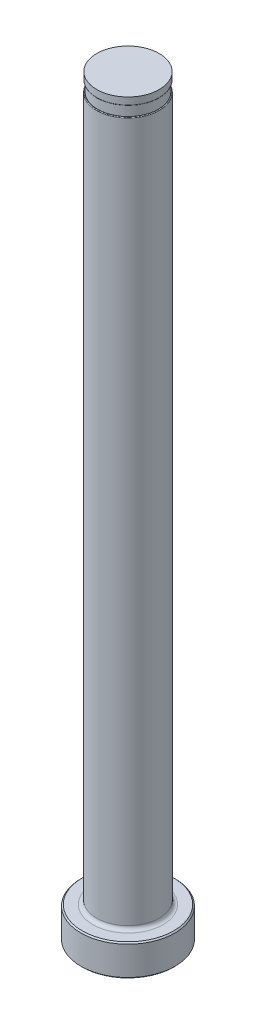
ISO-10303-21;
HEADER;
FILE_DESCRIPTION(('STEP AP214'),'2;1');
FILE_NAME('part.step','',(''),(''),'','','');
FILE_SCHEMA(('AUTOMOTIVE_DESIGN { 1 0 10303 214 1 1 1 1 }'));
ENDSEC;
DATA;
#1=APPLICATION_CONTEXT('core data for automotive mechanical design processes');
#2=APPLICATION_PROTOCOL_DEFINITION('international standard','automotive_design',2000,#1);
#3=PRODUCT_CONTEXT('',#1,'mechanical');
#4=PRODUCT('Part','Part','',(#3));
#5=PRODUCT_RELATED_PRODUCT_CATEGORY('part','',(#4));
#6=PRODUCT_DEFINITION_FORMATION('','',#4);
#7=PRODUCT_DEFINITION_CONTEXT('part definition',#1,'design');
#8=PRODUCT_DEFINITION('design','',#6,#7);
#9=PRODUCT_DEFINITION_SHAPE('','',#8);
#10=(LENGTH_UNIT() NAMED_UNIT(*) SI_UNIT(.MILLI.,.METRE.));
#11=(NAMED_UNIT(*) PLANE_ANGLE_UNIT() SI_UNIT($,.RADIAN.));
#12=(NAMED_UNIT(*) SI_UNIT($,.STERADIAN.) SOLID_ANGLE_UNIT());
#13=UNCERTAINTY_MEASURE_WITH_UNIT(LENGTH_MEASURE(1.E-05),#10,'distance_accuracy_value','');
#14=(GEOMETRIC_REPRESENTATION_CONTEXT(3) GLOBAL_UNCERTAINTY_ASSIGNED_CONTEXT((#13)) GLOBAL_UNIT_ASSIGNED_CONTEXT((#10,
#11,#12)) REPRESENTATION_CONTEXT('',''));
#15=CARTESIAN_POINT('',(0.,0.,0.));
#16=DIRECTION('',(0.,0.,1.));
#17=DIRECTION('',(1.,0.,0.));
#18=AXIS2_PLACEMENT_3D('',#15,#16,#17);
#19=CARTESIAN_POINT('',(-6.34999999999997,150.876,0.));
#20=DIRECTION('',(0.,1.,0.));
#21=DIRECTION('',(0.,0.,1.));
#22=AXIS2_PLACEMENT_3D('',#19,#20,#21);
#23=PLANE('',#22);
#24=CARTESIAN_POINT('',(0.,150.876,0.));
#25=DIRECTION('',(0.,1.,0.));
#26=DIRECTION('',(0.,0.,1.));
#27=AXIS2_PLACEMENT_3D('',#24,#25,#26);
#28=CIRCLE('',#27,6.19759999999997);
#29=CARTESIAN_POINT('',(0.,150.876,6.19759999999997));
#30=VERTEX_POINT('',#29);
#31=EDGE_CURVE('E11',#30,#30,#28,.F.);
#32=ORIENTED_EDGE('',*,*,#31,.T.);
#33=EDGE_LOOP('',(#32));
#34=FACE_BOUND('',#33,.T.);
#35=CARTESIAN_POINT('',(0.,150.876,0.));
#36=DIRECTION('',(0.,1.,0.));
#37=DIRECTION('',(0.,0.,1.));
#38=AXIS2_PLACEMENT_3D('',#35,#36,#37);
#39=CIRCLE('',#38,6.14679999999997);
#40=CARTESIAN_POINT('',(0.,150.876,6.14679999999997));
#41=VERTEX_POINT('',#40);
#42=EDGE_CURVE('E78',#41,#41,#39,.T.);
#43=ORIENTED_EDGE('',*,*,#42,.T.);
#44=EDGE_LOOP('',(#43));
#45=FACE_BOUND('',#44,.T.);
#46=ADVANCED_FACE('F36',(#34,#45),#23,.F.);
#47=CARTESIAN_POINT('',(0.,259.958771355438,0.));
#48=DIRECTION('',(0.,1.,0.));
#49=DIRECTION('',(0.,0.,1.));
#50=AXIS2_PLACEMENT_3D('',#47,#48,#49);
#51=CYLINDRICAL_SURFACE('',#50,6.34999999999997);
#52=DIRECTION('',(0.,1.,0.));
#53=VECTOR('',#52,1.);
#54=CARTESIAN_POINT('',(-6.14679999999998,259.958771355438,-1.59353373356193));
#55=LINE('',#54,#53);
#56=CARTESIAN_POINT('',(-6.14679999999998,148.717,-1.59353373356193));
#57=VERTEX_POINT('',#56);
#58=CARTESIAN_POINT('',(-6.14679999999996,86.36,-1.593533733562));
#59=VERTEX_POINT('',#58);
#60=EDGE_CURVE('E73',#57,#59,#55,.F.);
#61=ORIENTED_EDGE('',*,*,#60,.F.);
#62=CARTESIAN_POINT('',(0.,148.717,0.));
#63=DIRECTION('',(0.,-1.,0.));
#64=DIRECTION('',(0.,0.,-1.));
#65=AXIS2_PLACEMENT_3D('',#62,#63,#64);
#66=CIRCLE('',#65,6.34999999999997);
#67=CARTESIAN_POINT('',(-6.14679999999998,148.717,1.59353373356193));
#68=VERTEX_POINT('',#67);
#69=EDGE_CURVE('E51',#57,#68,#66,.T.);
#70=ORIENTED_EDGE('',*,*,#69,.T.);
#71=DIRECTION('',(0.,1.,0.));
#72=VECTOR('',#71,1.);
#73=CARTESIAN_POINT('',(-6.14679999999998,259.958771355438,1.59353373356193));
#74=LINE('',#73,#72);
#75=CARTESIAN_POINT('',(-6.14679999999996,86.36,1.593533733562));
#76=VERTEX_POINT('',#75);
#77=EDGE_CURVE('E84',#76,#68,#74,.T.);
#78=ORIENTED_EDGE('',*,*,#77,.F.);
#79=CARTESIAN_POINT('',(-6.14679999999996,86.36,-1.593533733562));
#80=CARTESIAN_POINT('',(-6.14679686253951,86.3324663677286,-1.59353938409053));
#81=CARTESIAN_POINT('',(-6.14715862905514,86.3049529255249,-1.59215087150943));
#82=CARTESIAN_POINT('',(-6.14858031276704,86.2502441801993,-1.58665454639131));
#83=CARTESIAN_POINT('',(-6.14963953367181,86.2230485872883,-1.58254944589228));
#84=CARTESIAN_POINT('',(-6.15378495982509,86.1428935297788,-1.56638373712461));
#85=CARTESIAN_POINT('',(-6.15784047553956,86.0907192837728,-1.55046902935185));
#86=CARTESIAN_POINT('',(-6.16796669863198,85.9905368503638,-1.50967436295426));
#87=CARTESIAN_POINT('',(-6.17403041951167,85.9425149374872,-1.48482546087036));
#88=CARTESIAN_POINT('',(-6.18749023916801,85.8512134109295,-1.42770042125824));
#89=CARTESIAN_POINT('',(-6.19488985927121,85.8079468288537,-1.39540459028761));
#90=CARTESIAN_POINT('',(-6.2128308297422,85.7135154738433,-1.31357934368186));
#91=CARTESIAN_POINT('',(-6.22361527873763,85.6643096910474,-1.26185217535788));
#92=CARTESIAN_POINT('',(-6.24504791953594,85.5749285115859,-1.15112070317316));
#93=CARTESIAN_POINT('',(-6.25569585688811,85.5347681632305,-1.0921045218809));
#94=CARTESIAN_POINT('',(-6.27981252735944,85.4491635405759,-0.945436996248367));
#95=CARTESIAN_POINT('',(-6.29280304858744,85.4075705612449,-0.855464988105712));
#96=CARTESIAN_POINT('',(-6.3152685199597,85.33888021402,-0.669832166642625));
#97=CARTESIAN_POINT('',(-6.32474033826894,85.3117957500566,-0.574166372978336));
#98=CARTESIAN_POINT('',(-6.33958312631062,85.2702724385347,-0.377105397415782));
#99=CARTESIAN_POINT('',(-6.34483489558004,85.256199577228,-0.275625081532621));
#100=CARTESIAN_POINT('',(-6.35041977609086,85.2412595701,-0.0715187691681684));
#101=CARTESIAN_POINT('',(-6.35074885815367,85.240403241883,0.031108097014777));
#102=CARTESIAN_POINT('',(-6.34600640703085,85.2530416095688,0.25671763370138));
#103=CARTESIAN_POINT('',(-6.33980431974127,85.2695397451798,0.37952238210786));
#104=CARTESIAN_POINT('',(-6.32079279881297,85.322979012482,0.620117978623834));
#105=CARTESIAN_POINT('',(-6.30799326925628,85.3598895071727,0.737916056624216));
#106=CARTESIAN_POINT('',(-6.28320612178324,85.4388252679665,0.921417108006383));
#107=CARTESIAN_POINT('',(-6.27266140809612,85.4739385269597,0.990304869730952));
#108=CARTESIAN_POINT('',(-6.25047734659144,85.5541826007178,1.12180209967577));
#109=CARTESIAN_POINT('',(-6.23883987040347,85.5992964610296,1.18442193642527));
#110=CARTESIAN_POINT('',(-6.21836351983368,85.6885218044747,1.28706750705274));
#111=CARTESIAN_POINT('',(-6.20949901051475,85.7304586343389,1.32897137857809));
#112=CARTESIAN_POINT('',(-6.19260904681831,85.820662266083,1.40556985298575));
#113=CARTESIAN_POINT('',(-6.18458268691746,85.8689221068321,1.44027227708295));
#114=CARTESIAN_POINT('',(-6.17157345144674,85.961899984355,1.49493371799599));
#115=CARTESIAN_POINT('',(-6.16630262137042,86.0056744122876,1.51642497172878));
#116=CARTESIAN_POINT('',(-6.1574469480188,86.0962717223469,1.55199425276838));
#117=CARTESIAN_POINT('',(-6.15385883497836,86.1430884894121,1.56608666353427));
#118=CARTESIAN_POINT('',(-6.14982923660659,86.2185672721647,1.58181403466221));
#119=CARTESIAN_POINT('',(-6.14869942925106,86.2466434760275,1.58619374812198));
#120=CARTESIAN_POINT('',(-6.147182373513,86.3031398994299,1.59205902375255));
#121=CARTESIAN_POINT('',(-6.14679576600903,86.3315603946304,1.59354208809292));
#122=CARTESIAN_POINT('',(-6.14679999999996,86.36,1.593533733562));
#123=B_SPLINE_CURVE_WITH_KNOTS('',3,(#79,#80,#81,#82,#83,#84,#85,#86,#87,#88,#89,#90,#91,#92,
#93,#94,#95,#96,#97,#98,#99,#100,#101,#102,#103,#104,#105,#106,#107,#108,#109,#110,#111,#112,
#113,#114,#115,#116,#117,#118,#119,#120,#121,#122),.UNSPECIFIED.,.F.,.F.,(4,2,2,2,2,2,2,2,2,2,2,
2,2,2,2,2,2,2,2,2,2,4),(0.,0.0825255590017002,0.164968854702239,0.327951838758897,
0.490373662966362,0.653230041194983,0.868657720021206,1.08444118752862,1.38273372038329,
1.68129111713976,1.9880112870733,2.29498249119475,2.66541500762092,3.03529304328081,
3.26869881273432,3.50171186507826,3.68091203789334,3.85991655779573,4.00647458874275,
4.15274664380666,4.23791544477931,4.32315765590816),.UNSPECIFIED.);
#124=EDGE_CURVE('E81',#59,#76,#123,.T.);
#125=ORIENTED_EDGE('',*,*,#124,.F.);
#126=EDGE_LOOP('',(#61,#70,#78,#125));
#127=FACE_BOUND('',#126,.T.);
#128=CARTESIAN_POINT('',(0.,7.11200000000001,0.));
#129=DIRECTION('',(0.,1.,0.));
#130=DIRECTION('',(0.,0.,1.));
#131=AXIS2_PLACEMENT_3D('',#128,#129,#130);
#132=CIRCLE('',#131,6.34999999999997);
#133=CARTESIAN_POINT('',(0.,7.11200000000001,6.34999999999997));
#134=VERTEX_POINT('',#133);
#135=EDGE_CURVE('E116',#134,#134,#132,.T.);
#136=ORIENTED_EDGE('',*,*,#135,.T.);
#137=EDGE_LOOP('',(#136));
#138=FACE_BOUND('',#137,.T.);
#139=ADVANCED_FACE('F82',(#127,#138),#51,.T.);
#140=CARTESIAN_POINT('',(0.,0.,0.));
#141=DIRECTION('',(0.,-1.,0.));
#142=DIRECTION('',(0.,0.,-1.));
#143=AXIS2_PLACEMENT_3D('',#140,#141,#142);
#144=PLANE('',#143);
#145=CARTESIAN_POINT('',(0.,0.,0.));
#146=DIRECTION('',(0.,-1.,0.));
#147=DIRECTION('',(0.,0.,-1.));
#148=AXIS2_PLACEMENT_3D('',#145,#146,#147);
#149=CIRCLE('',#148,9.271);
#150=CARTESIAN_POINT('',(0.,0.,-9.271));
#151=VERTEX_POINT('',#150);
#152=EDGE_CURVE('E113',#151,#151,#149,.T.);
#153=ORIENTED_EDGE('',*,*,#152,.T.);
#154=EDGE_LOOP('',(#153));
#155=FACE_BOUND('',#154,.T.);
#156=ADVANCED_FACE('F192',(#155),#144,.T.);
#157=CARTESIAN_POINT('',(0.,259.958771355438,0.));
#158=DIRECTION('',(0.,1.,0.));
#159=DIRECTION('',(0.,0.,1.));
#160=AXIS2_PLACEMENT_3D('',#157,#158,#159);
#161=CYLINDRICAL_SURFACE('',#160,9.52499999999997);
#162=CARTESIAN_POINT('',(0.,6.09600000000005,0.));
#163=DIRECTION('',(0.,1.,0.));
#164=DIRECTION('',(0.,0.,1.));
#165=AXIS2_PLACEMENT_3D('',#162,#163,#164);
#166=CIRCLE('',#165,9.52499999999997);
#167=CARTESIAN_POINT('',(0.,6.09600000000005,9.52499999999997));
#168=VERTEX_POINT('',#167);
#169=EDGE_CURVE('E110',#168,#168,#166,.F.);
#170=ORIENTED_EDGE('',*,*,#169,.T.);
#171=EDGE_LOOP('',(#170));
#172=FACE_BOUND('',#171,.T.);
#173=CARTESIAN_POINT('',(0.,0.253999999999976,0.));
#174=DIRECTION('',(0.,-1.,0.));
#175=DIRECTION('',(0.,0.,-1.));
#176=AXIS2_PLACEMENT_3D('',#173,#174,#175);
#177=CIRCLE('',#176,9.52499999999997);
#178=CARTESIAN_POINT('',(0.,0.253999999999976,-9.52499999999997));
#179=VERTEX_POINT('',#178);
#180=EDGE_CURVE('E107',#179,#179,#177,.F.);
#181=ORIENTED_EDGE('',*,*,#180,.T.);
#182=EDGE_LOOP('',(#181));
#183=FACE_BOUND('',#182,.T.);
#184=ADVANCED_FACE('F195',(#172,#183),#161,.T.);
#185=CARTESIAN_POINT('',(-9.52499999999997,6.35,0.));
#186=DIRECTION('',(0.,1.,0.));
#187=DIRECTION('',(0.,0.,1.));
#188=AXIS2_PLACEMENT_3D('',#185,#186,#187);
#189=PLANE('',#188);
#190=CARTESIAN_POINT('',(0.,6.35,0.));
#191=DIRECTION('',(0.,1.,0.));
#192=DIRECTION('',(0.,0.,1.));
#193=AXIS2_PLACEMENT_3D('',#190,#191,#192);
#194=CIRCLE('',#193,7.11199999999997);
#195=CARTESIAN_POINT('',(0.,6.35,7.11199999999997));
#196=VERTEX_POINT('',#195);
#197=EDGE_CURVE('E87',#196,#196,#194,.F.);
#198=ORIENTED_EDGE('',*,*,#197,.T.);
#199=EDGE_LOOP('',(#198));
#200=FACE_BOUND('',#199,.T.);
#201=CARTESIAN_POINT('',(0.,6.35,0.));
#202=DIRECTION('',(0.,1.,0.));
#203=DIRECTION('',(0.,0.,1.));
#204=AXIS2_PLACEMENT_3D('',#201,#202,#203);
#205=CIRCLE('',#204,9.27100000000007);
#206=CARTESIAN_POINT('',(0.,6.35,9.27100000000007));
#207=VERTEX_POINT('',#206);
#208=EDGE_CURVE('E104',#207,#207,#205,.T.);
#209=ORIENTED_EDGE('',*,*,#208,.T.);
#210=EDGE_LOOP('',(#209));
#211=FACE_BOUND('',#210,.T.);
#212=ADVANCED_FACE('F190',(#200,#211),#189,.T.);
#213=CARTESIAN_POINT('',(0.,6.35000000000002,0.));
#214=DIRECTION('',(0.,-1.,0.));
#215=DIRECTION('',(0.,0.,-1.));
#216=AXIS2_PLACEMENT_3D('',#213,#214,#215);
#217=CONICAL_SURFACE('',#216,9.27100000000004,0.785398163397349);
#218=ORIENTED_EDGE('',*,*,#169,.F.);
#219=EDGE_LOOP('',(#218));
#220=FACE_BOUND('',#219,.T.);
#221=ORIENTED_EDGE('',*,*,#208,.F.);
#222=EDGE_LOOP('',(#221));
#223=FACE_BOUND('',#222,.T.);
#224=ADVANCED_FACE('F186',(#220,#223),#217,.T.);
#225=CARTESIAN_POINT('',(0.,0.253999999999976,0.));
#226=DIRECTION('',(0.,1.,0.));
#227=DIRECTION('',(0.,0.,1.));
#228=AXIS2_PLACEMENT_3D('',#225,#226,#227);
#229=CONICAL_SURFACE('',#228,9.52499999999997,0.785398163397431);
#230=ORIENTED_EDGE('',*,*,#152,.F.);
#231=EDGE_LOOP('',(#230));
#232=FACE_BOUND('',#231,.T.);
#233=ORIENTED_EDGE('',*,*,#180,.F.);
#234=EDGE_LOOP('',(#233));
#235=FACE_BOUND('',#234,.T.);
#236=ADVANCED_FACE('F182',(#232,#235),#229,.T.);
#237=CARTESIAN_POINT('',(0.,7.11200000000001,0.));
#238=DIRECTION('',(0.,1.,0.));
#239=DIRECTION('',(0.,0.,1.));
#240=AXIS2_PLACEMENT_3D('',#237,#238,#239);
#241=TOROIDAL_SURFACE('',#240,7.11199999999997,0.762);
#242=ORIENTED_EDGE('',*,*,#197,.F.);
#243=EDGE_LOOP('',(#242));
#244=FACE_BOUND('',#243,.T.);
#245=ORIENTED_EDGE('',*,*,#135,.F.);
#246=EDGE_LOOP('',(#245));
#247=FACE_BOUND('',#246,.T.);
#248=ADVANCED_FACE('F147',(#244,#247),#241,.F.);
#249=CARTESIAN_POINT('',(-6.34999999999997,148.844,0.));
#250=DIRECTION('',(0.,-1.,0.));
#251=DIRECTION('',(0.,0.,-1.));
#252=AXIS2_PLACEMENT_3D('',#249,#250,#251);
#253=PLANE('',#252);
#254=DIRECTION('',(0.,0.,1.));
#255=VECTOR('',#254,1.);
#256=CARTESIAN_POINT('',(-6.14679999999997,148.844,0.));
#257=LINE('',#256,#255);
#258=CARTESIAN_POINT('',(-6.14679999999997,148.844,0.));
#259=VERTEX_POINT('',#258);
#260=CARTESIAN_POINT('',(-6.14679999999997,148.844,0.970864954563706));
#261=VERTEX_POINT('',#260);
#262=EDGE_CURVE('E90',#259,#261,#257,.T.);
#263=ORIENTED_EDGE('',*,*,#262,.T.);
#264=CARTESIAN_POINT('',(0.,148.844,0.));
#265=DIRECTION('',(0.,-1.,0.));
#266=DIRECTION('',(0.,0.,-1.));
#267=AXIS2_PLACEMENT_3D('',#264,#265,#266);
#268=CIRCLE('',#267,6.22299999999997);
#269=CARTESIAN_POINT('',(-6.14679999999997,148.844,-0.970864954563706));
#270=VERTEX_POINT('',#269);
#271=EDGE_CURVE('E86',#261,#270,#268,.F.);
#272=ORIENTED_EDGE('',*,*,#271,.T.);
#273=EDGE_CURVE('E79',#270,#259,#257,.T.);
#274=ORIENTED_EDGE('',*,*,#273,.T.);
#275=CARTESIAN_POINT('',(0.,148.844,0.));
#276=DIRECTION('',(0.,1.,0.));
#277=DIRECTION('',(0.,0.,1.));
#278=AXIS2_PLACEMENT_3D('',#275,#276,#277);
#279=CIRCLE('',#278,6.14679999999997);
#280=EDGE_CURVE('E101',#259,#259,#279,.T.);
#281=ORIENTED_EDGE('',*,*,#280,.F.);
#282=EDGE_LOOP('',(#263,#272,#274,#281));
#283=FACE_BOUND('',#282,.T.);
#284=ADVANCED_FACE('F144',(#283),#253,.F.);
#285=CARTESIAN_POINT('',(0.,153.448281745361,0.));
#286=DIRECTION('',(0.,1.,0.));
#287=DIRECTION('',(0.,0.,1.));
#288=AXIS2_PLACEMENT_3D('',#285,#286,#287);
#289=CYLINDRICAL_SURFACE('',#288,6.14679999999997);
#290=ORIENTED_EDGE('',*,*,#42,.F.);
#291=EDGE_LOOP('',(#290));
#292=FACE_BOUND('',#291,.T.);
#293=ORIENTED_EDGE('',*,*,#280,.T.);
#294=EDGE_LOOP('',(#293));
#295=FACE_BOUND('',#294,.T.);
#296=ADVANCED_FACE('F141',(#292,#295),#289,.T.);
#297=CARTESIAN_POINT('',(-6.14679999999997,149.86,-9.52499999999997));
#298=DIRECTION('',(1.,0.,0.));
#299=DIRECTION('',(0.,1.,0.));
#300=AXIS2_PLACEMENT_3D('',#297,#298,#299);
#301=PLANE('',#300);
#302=ORIENTED_EDGE('',*,*,#273,.F.);
#303=CARTESIAN_POINT('',(-6.14679999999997,148.844,-0.970864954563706));
#304=CARTESIAN_POINT('',(-6.14679999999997,148.843999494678,-0.99202805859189));
#305=CARTESIAN_POINT('',(-6.14679999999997,148.84387177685,-1.01319058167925));
#306=CARTESIAN_POINT('',(-6.14679999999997,148.843304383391,-1.05551642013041));
#307=CARTESIAN_POINT('',(-6.14679999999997,148.842864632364,-1.07667973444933));
#308=CARTESIAN_POINT('',(-6.14679999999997,148.84098930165,-1.14021803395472));
#309=CARTESIAN_POINT('',(-6.14679999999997,148.838997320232,-1.18258174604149));
#310=CARTESIAN_POINT('',(-6.14679999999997,148.83436583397,-1.24564697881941));
#311=CARTESIAN_POINT('',(-6.14679999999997,148.832570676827,-1.26640955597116));
#312=CARTESIAN_POINT('',(-6.14679999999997,148.828292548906,-1.30785556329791));
#313=CARTESIAN_POINT('',(-6.14679999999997,148.825809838,-1.32853902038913));
#314=CARTESIAN_POINT('',(-6.14679999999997,148.81886463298,-1.37752764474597));
#315=CARTESIAN_POINT('',(-6.14679999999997,148.814008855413,-1.40578261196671));
#316=CARTESIAN_POINT('',(-6.14679999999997,148.803486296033,-1.45315312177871));
#317=CARTESIAN_POINT('',(-6.14679999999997,148.798522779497,-1.47241873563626));
#318=CARTESIAN_POINT('',(-6.14679999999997,148.788243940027,-1.50466142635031));
#319=CARTESIAN_POINT('',(-6.14679999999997,148.783474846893,-1.51780066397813));
#320=CARTESIAN_POINT('',(-6.14679999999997,148.774759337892,-1.53746298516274));
#321=CARTESIAN_POINT('',(-6.14679999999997,148.771436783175,-1.54425972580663));
#322=CARTESIAN_POINT('',(-6.14679999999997,148.764050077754,-1.55743156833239));
#323=CARTESIAN_POINT('',(-6.14679999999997,148.759989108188,-1.56380832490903));
#324=CARTESIAN_POINT('',(-6.14679999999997,148.753517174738,-1.57208690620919));
#325=CARTESIAN_POINT('',(-6.14679999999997,148.751591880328,-1.57436448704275));
#326=CARTESIAN_POINT('',(-6.14679999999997,148.747512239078,-1.57872030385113));
#327=CARTESIAN_POINT('',(-6.14679999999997,148.745357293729,-1.58079799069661));
#328=CARTESIAN_POINT('',(-6.14679999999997,148.740744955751,-1.58467787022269));
#329=CARTESIAN_POINT('',(-6.14679999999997,148.738283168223,-1.58647496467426));
#330=CARTESIAN_POINT('',(-6.14679999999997,148.733073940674,-1.58956779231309));
#331=CARTESIAN_POINT('',(-6.14679999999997,148.730329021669,-1.59086753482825));
#332=CARTESIAN_POINT('',(-6.14679999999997,148.725789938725,-1.59236406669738));
#333=CARTESIAN_POINT('',(-6.14679999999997,148.724073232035,-1.5927947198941));
#334=CARTESIAN_POINT('',(-6.14679999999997,148.720573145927,-1.59338315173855));
#335=CARTESIAN_POINT('',(-6.14679999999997,148.718789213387,-1.59353759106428));
#336=CARTESIAN_POINT('',(-6.14679999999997,148.717,-1.59353373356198));
#337=B_SPLINE_CURVE_WITH_KNOTS('',3,(#303,#304,#305,#306,#307,#308,#309,#310,#311,#312,#313,
#314,#315,#316,#317,#318,#319,#320,#321,#322,#323,#324,#325,#326,#327,#328,#329,#330,#331,#332,
#333,#334,#335,#336),.UNSPECIFIED.,.F.,.F.,(4,2,2,2,2,2,2,2,2,2,2,2,2,2,2,2,4),(0.,
0.0634873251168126,0.126989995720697,0.254174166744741,0.31668466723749,0.379171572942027,
0.465088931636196,0.524705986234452,0.566546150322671,0.589220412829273,0.611799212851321,
0.620735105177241,0.629694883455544,0.638802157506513,0.647834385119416,0.653123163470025,
0.658475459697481),.UNSPECIFIED.);
#338=EDGE_CURVE('E59',#270,#57,#337,.T.);
#339=ORIENTED_EDGE('',*,*,#338,.T.);
#340=ORIENTED_EDGE('',*,*,#60,.T.);
#341=DIRECTION('',(0.,0.,1.));
#342=VECTOR('',#341,1.);
#343=CARTESIAN_POINT('',(-6.14679999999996,86.36,-9.52499999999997));
#344=LINE('',#343,#342);
#345=EDGE_CURVE('E77',#59,#76,#344,.T.);
#346=ORIENTED_EDGE('',*,*,#345,.T.);
#347=ORIENTED_EDGE('',*,*,#77,.T.);
#348=CARTESIAN_POINT('',(-6.14679999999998,148.717,1.59353373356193));
#349=CARTESIAN_POINT('',(-6.14679999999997,148.719212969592,1.59354190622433));
#350=CARTESIAN_POINT('',(-6.14679999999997,148.721413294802,1.59330365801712));
#351=CARTESIAN_POINT('',(-6.14679999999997,148.7256934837,1.59241515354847));
#352=CARTESIAN_POINT('',(-6.14679999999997,148.727774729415,1.59177170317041));
#353=CARTESIAN_POINT('',(-6.14679999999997,148.732264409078,1.58996085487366));
#354=CARTESIAN_POINT('',(-6.14679999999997,148.734636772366,1.58870654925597));
#355=CARTESIAN_POINT('',(-6.14679999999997,148.739163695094,1.58583480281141));
#356=CARTESIAN_POINT('',(-6.14679999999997,148.741316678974,1.58421497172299));
#357=CARTESIAN_POINT('',(-6.14679999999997,148.747009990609,1.57937157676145));
#358=CARTESIAN_POINT('',(-6.14679999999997,148.750321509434,1.57588310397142));
#359=CARTESIAN_POINT('',(-6.14679999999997,148.756438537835,1.56850014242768));
#360=CARTESIAN_POINT('',(-6.14679999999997,148.75924308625,1.56460490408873));
#361=CARTESIAN_POINT('',(-6.14679999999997,148.76593924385,1.55433442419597));
#362=CARTESIAN_POINT('',(-6.14679999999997,148.769564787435,1.54778763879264));
#363=CARTESIAN_POINT('',(-6.14679999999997,148.776209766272,1.5343888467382));
#364=CARTESIAN_POINT('',(-6.14679999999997,148.779227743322,1.52753615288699));
#365=CARTESIAN_POINT('',(-6.14679999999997,148.787649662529,1.50664917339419));
#366=CARTESIAN_POINT('',(-6.14679999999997,148.792386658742,1.49234856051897));
#367=CARTESIAN_POINT('',(-6.14679999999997,148.800853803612,1.46319301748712));
#368=CARTESIAN_POINT('',(-6.14679999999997,148.804564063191,1.44833273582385));
#369=CARTESIAN_POINT('',(-6.14679999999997,148.811191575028,1.41843325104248));
#370=CARTESIAN_POINT('',(-6.14679999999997,148.814108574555,1.40339399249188));
#371=CARTESIAN_POINT('',(-6.14679999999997,148.821988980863,1.3580554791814));
#372=CARTESIAN_POINT('',(-6.14679999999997,148.826064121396,1.32760471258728));
#373=CARTESIAN_POINT('',(-6.14679999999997,148.832693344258,1.26653961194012));
#374=CARTESIAN_POINT('',(-6.14679999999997,148.835246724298,1.23592520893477));
#375=CARTESIAN_POINT('',(-6.14679999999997,148.839251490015,1.1746618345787));
#376=CARTESIAN_POINT('',(-6.14679999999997,148.840704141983,1.1440129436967));
#377=CARTESIAN_POINT('',(-6.14679999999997,148.842556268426,1.08956123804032));
#378=CARTESIAN_POINT('',(-6.14679999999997,148.843118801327,1.06576333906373));
#379=CARTESIAN_POINT('',(-6.14679999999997,148.84383839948,1.01826491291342));
#380=CARTESIAN_POINT('',(-6.14679999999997,148.843997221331,0.994564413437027));
#381=CARTESIAN_POINT('',(-6.14679999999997,148.844,0.970864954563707));
#382=B_SPLINE_CURVE_WITH_KNOTS('',3,(#348,#349,#350,#351,#352,#353,#354,#355,#356,#357,#358,
#359,#360,#361,#362,#363,#364,#365,#366,#367,#368,#369,#370,#371,#372,#373,#374,#375,#376,#377,
#378,#379,#380,#381),.UNSPECIFIED.,.F.,.F.,(4,2,2,2,2,2,2,2,2,2,2,2,2,2,2,2,4),(0.,
0.00660592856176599,0.0131037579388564,0.0211086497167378,0.0291674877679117,0.0435165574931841,
0.0578925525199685,0.0802861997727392,0.102732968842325,0.147839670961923,0.193767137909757,
0.239709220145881,0.331806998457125,0.423947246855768,0.515981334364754,0.587391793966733,
0.658491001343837),.UNSPECIFIED.);
#383=EDGE_CURVE('E172',#68,#261,#382,.T.);
#384=ORIENTED_EDGE('',*,*,#383,.T.);
#385=ORIENTED_EDGE('',*,*,#262,.F.);
#386=EDGE_LOOP('',(#302,#339,#340,#346,#347,#384,#385));
#387=FACE_BOUND('',#386,.T.);
#388=ADVANCED_FACE('F75',(#387),#301,.F.);
#389=CARTESIAN_POINT('',(-9.32179999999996,86.36,-9.52499999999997));
#390=DIRECTION('',(0.,0.,1.));
#391=DIRECTION('',(1.,0.,0.));
#392=AXIS2_PLACEMENT_3D('',#389,#390,#391);
#393=CYLINDRICAL_SURFACE('',#392,3.175);
#394=ORIENTED_EDGE('',*,*,#345,.F.);
#395=ORIENTED_EDGE('',*,*,#124,.T.);
#396=EDGE_LOOP('',(#394,#395));
#397=FACE_BOUND('',#396,.T.);
#398=ADVANCED_FACE('F89',(#397),#393,.F.);
#399=CARTESIAN_POINT('',(0.,152.687735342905,0.));
#400=DIRECTION('',(0.,1.,0.));
#401=DIRECTION('',(0.,0.,1.));
#402=AXIS2_PLACEMENT_3D('',#399,#400,#401);
#403=CYLINDRICAL_SURFACE('',#402,6.32459999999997);
#404=CARTESIAN_POINT('',(0.,151.003,0.));
#405=DIRECTION('',(0.,1.,0.));
#406=DIRECTION('',(0.,0.,1.));
#407=AXIS2_PLACEMENT_3D('',#404,#405,#406);
#408=CIRCLE('',#407,6.32459999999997);
#409=CARTESIAN_POINT('',(0.,151.003,6.32459999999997));
#410=VERTEX_POINT('',#409);
#411=EDGE_CURVE('E44',#410,#410,#408,.T.);
#412=ORIENTED_EDGE('',*,*,#411,.T.);
#413=EDGE_LOOP('',(#412));
#414=FACE_BOUND('',#413,.T.);
#415=CARTESIAN_POINT('',(0.,152.4,0.));
#416=DIRECTION('',(0.,1.,0.));
#417=DIRECTION('',(0.,0.,1.));
#418=AXIS2_PLACEMENT_3D('',#415,#416,#417);
#419=CIRCLE('',#418,6.32459999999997);
#420=CARTESIAN_POINT('',(0.,152.4,6.32459999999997));
#421=VERTEX_POINT('',#420);
#422=EDGE_CURVE('E91',#421,#421,#419,.T.);
#423=ORIENTED_EDGE('',*,*,#422,.F.);
#424=EDGE_LOOP('',(#423));
#425=FACE_BOUND('',#424,.T.);
#426=ADVANCED_FACE('F135',(#414,#425),#403,.T.);
#427=CARTESIAN_POINT('',(-6.34999999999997,152.4,0.));
#428=DIRECTION('',(0.,1.,0.));
#429=DIRECTION('',(0.,0.,1.));
#430=AXIS2_PLACEMENT_3D('',#427,#428,#429);
#431=PLANE('',#430);
#432=ORIENTED_EDGE('',*,*,#422,.T.);
#433=EDGE_LOOP('',(#432));
#434=FACE_BOUND('',#433,.T.);
#435=ADVANCED_FACE('F149',(#434),#431,.T.);
#436=CARTESIAN_POINT('',(0.,148.717,0.));
#437=DIRECTION('',(0.,-1.,0.));
#438=DIRECTION('',(0.,0.,-1.));
#439=AXIS2_PLACEMENT_3D('',#436,#437,#438);
#440=TOROIDAL_SURFACE('',#439,6.22299999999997,0.127);
#441=ORIENTED_EDGE('',*,*,#383,.F.);
#442=ORIENTED_EDGE('',*,*,#69,.F.);
#443=ORIENTED_EDGE('',*,*,#338,.F.);
#444=ORIENTED_EDGE('',*,*,#271,.F.);
#445=EDGE_LOOP('',(#441,#442,#443,#444));
#446=FACE_BOUND('',#445,.T.);
#447=ADVANCED_FACE('F151',(#446),#440,.T.);
#448=CARTESIAN_POINT('',(0.,151.003,0.));
#449=DIRECTION('',(0.,1.,0.));
#450=DIRECTION('',(0.,0.,1.));
#451=AXIS2_PLACEMENT_3D('',#448,#449,#450);
#452=TOROIDAL_SURFACE('',#451,6.19759999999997,0.127);
#453=ORIENTED_EDGE('',*,*,#31,.F.);
#454=EDGE_LOOP('',(#453));
#455=FACE_BOUND('',#454,.T.);
#456=ORIENTED_EDGE('',*,*,#411,.F.);
#457=EDGE_LOOP('',(#456));
#458=FACE_BOUND('',#457,.T.);
#459=ADVANCED_FACE('F38',(#455,#458),#452,.T.);
#460=CLOSED_SHELL('',(#46,#139,#156,#184,#212,#224,#236,#248,#284,#296,#388,#398,#426,#435,#447,#459));
#461=MANIFOLD_SOLID_BREP('B2',#460);
#462=ADVANCED_BREP_SHAPE_REPRESENTATION('',(#18,#461),#14);
#463=SHAPE_DEFINITION_REPRESENTATION(#9,#462);
ENDSEC;
END-ISO-10303-21;
